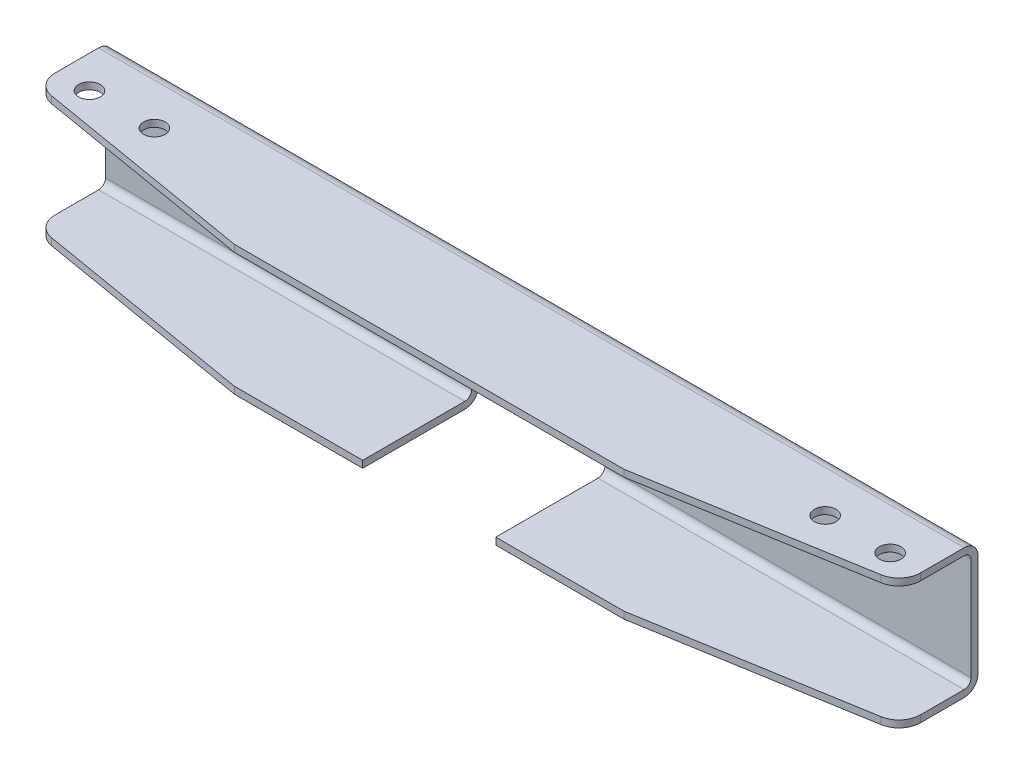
ISO-10303-21;
HEADER;
FILE_DESCRIPTION(('STEP AP214'),'2;1');
FILE_NAME('part.step','',(''),(''),'','','');
FILE_SCHEMA(('AUTOMOTIVE_DESIGN { 1 0 10303 214 1 1 1 1 }'));
ENDSEC;
DATA;
#1=APPLICATION_CONTEXT('core data for automotive mechanical design processes');
#2=APPLICATION_PROTOCOL_DEFINITION('international standard','automotive_design',2000,#1);
#3=PRODUCT_CONTEXT('',#1,'mechanical');
#4=PRODUCT('Part','Part','',(#3));
#5=PRODUCT_RELATED_PRODUCT_CATEGORY('part','',(#4));
#6=PRODUCT_DEFINITION_FORMATION('','',#4);
#7=PRODUCT_DEFINITION_CONTEXT('part definition',#1,'design');
#8=PRODUCT_DEFINITION('design','',#6,#7);
#9=PRODUCT_DEFINITION_SHAPE('','',#8);
#10=(LENGTH_UNIT() NAMED_UNIT(*) SI_UNIT(.MILLI.,.METRE.));
#11=(NAMED_UNIT(*) PLANE_ANGLE_UNIT() SI_UNIT($,.RADIAN.));
#12=(NAMED_UNIT(*) SI_UNIT($,.STERADIAN.) SOLID_ANGLE_UNIT());
#13=UNCERTAINTY_MEASURE_WITH_UNIT(LENGTH_MEASURE(1.E-05),#10,'distance_accuracy_value','');
#14=(GEOMETRIC_REPRESENTATION_CONTEXT(3) GLOBAL_UNCERTAINTY_ASSIGNED_CONTEXT((#13)) GLOBAL_UNIT_ASSIGNED_CONTEXT((#10,
#11,#12)) REPRESENTATION_CONTEXT('',''));
#15=CARTESIAN_POINT('',(0.,0.,0.));
#16=DIRECTION('',(0.,0.,1.));
#17=DIRECTION('',(1.,0.,0.));
#18=AXIS2_PLACEMENT_3D('',#15,#16,#17);
#19=CARTESIAN_POINT('',(400.,-30.,-23.6));
#20=DIRECTION('',(0.,1.,0.));
#21=DIRECTION('',(0.,0.,1.));
#22=AXIS2_PLACEMENT_3D('',#19,#20,#21);
#23=PLANE('',#22);
#24=DIRECTION('',(-0.986003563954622,0.,-0.166724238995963));
#25=VECTOR('',#24,1.);
#26=CARTESIAN_POINT('',(0.,-30.,5.));
#27=LINE('',#26,#25);
#28=CARTESIAN_POINT('',(110.,-30.,23.6));
#29=VERTEX_POINT('',#28);
#30=CARTESIAN_POINT('',(8.33275761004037,-30.,6.40899355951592));
#31=VERTEX_POINT('',#30);
#32=EDGE_CURVE('E552',#29,#31,#27,.T.);
#33=ORIENTED_EDGE('',*,*,#32,.T.);
#34=CARTESIAN_POINT('',(10.,-30.,-3.4510420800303));
#35=DIRECTION('',(0.,1.,0.));
#36=DIRECTION('',(0.,0.,1.));
#37=AXIS2_PLACEMENT_3D('',#34,#35,#36);
#38=CIRCLE('',#37,10.);
#39=CARTESIAN_POINT('',(0.,-30.,-3.45104208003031));
#40=VERTEX_POINT('',#39);
#41=EDGE_CURVE('E83',#31,#40,#38,.F.);
#42=ORIENTED_EDGE('',*,*,#41,.T.);
#43=DIRECTION('',(0.,0.,-1.));
#44=VECTOR('',#43,1.);
#45=CARTESIAN_POINT('',(0.,-30.,-23.6));
#46=LINE('',#45,#44);
#47=CARTESIAN_POINT('',(0.,-30.,-23.6));
#48=VERTEX_POINT('',#47);
#49=EDGE_CURVE('E419',#40,#48,#46,.T.);
#50=ORIENTED_EDGE('',*,*,#49,.T.);
#51=DIRECTION('',(-1.,0.,0.));
#52=VECTOR('',#51,1.);
#53=CARTESIAN_POINT('',(400.,-30.,-23.6));
#54=LINE('',#53,#52);
#55=CARTESIAN_POINT('',(169.25,-30.,-23.6));
#56=VERTEX_POINT('',#55);
#57=EDGE_CURVE('E445',#56,#48,#54,.T.);
#58=ORIENTED_EDGE('',*,*,#57,.F.);
#59=DIRECTION('',(0.,0.,-1.));
#60=VECTOR('',#59,1.);
#61=CARTESIAN_POINT('',(169.25,-30.,23.601));
#62=LINE('',#61,#60);
#63=CARTESIAN_POINT('',(169.25,-30.,23.6));
#64=VERTEX_POINT('',#63);
#65=EDGE_CURVE('E584',#64,#56,#62,.T.);
#66=ORIENTED_EDGE('',*,*,#65,.F.);
#67=DIRECTION('',(-1.,0.,0.));
#68=VECTOR('',#67,1.);
#69=CARTESIAN_POINT('',(400.,-30.,23.6));
#70=LINE('',#69,#68);
#71=EDGE_CURVE('E447',#64,#29,#70,.T.);
#72=ORIENTED_EDGE('',*,*,#71,.T.);
#73=EDGE_LOOP('',(#33,#42,#50,#58,#66,#72));
#74=FACE_BOUND('',#73,.T.);
#75=ADVANCED_FACE('F60',(#74),#23,.F.);
#76=CARTESIAN_POINT('',(400.,-26.8,-23.6));
#77=DIRECTION('',(0.,1.,0.));
#78=DIRECTION('',(0.,0.,1.));
#79=AXIS2_PLACEMENT_3D('',#76,#77,#78);
#80=PLANE('',#79);
#81=DIRECTION('',(0.,0.,-1.));
#82=VECTOR('',#81,1.);
#83=CARTESIAN_POINT('',(0.,-26.8,-23.6));
#84=LINE('',#83,#82);
#85=CARTESIAN_POINT('',(0.,-26.8,-3.45104208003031));
#86=VERTEX_POINT('',#85);
#87=CARTESIAN_POINT('',(0.,-26.8,-23.6));
#88=VERTEX_POINT('',#87);
#89=EDGE_CURVE('E337',#86,#88,#84,.T.);
#90=ORIENTED_EDGE('',*,*,#89,.F.);
#91=CARTESIAN_POINT('',(10.,-26.8,-3.4510420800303));
#92=DIRECTION('',(0.,1.,0.));
#93=DIRECTION('',(0.,0.,1.));
#94=AXIS2_PLACEMENT_3D('',#91,#92,#93);
#95=CIRCLE('',#94,10.);
#96=CARTESIAN_POINT('',(8.33275761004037,-26.8,6.40899355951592));
#97=VERTEX_POINT('',#96);
#98=EDGE_CURVE('E68',#86,#97,#95,.T.);
#99=ORIENTED_EDGE('',*,*,#98,.T.);
#100=DIRECTION('',(-0.986003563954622,0.,-0.166724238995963));
#101=VECTOR('',#100,1.);
#102=CARTESIAN_POINT('',(0.,-26.8,5.));
#103=LINE('',#102,#101);
#104=CARTESIAN_POINT('',(110.,-26.8,23.6));
#105=VERTEX_POINT('',#104);
#106=EDGE_CURVE('E335',#105,#97,#103,.T.);
#107=ORIENTED_EDGE('',*,*,#106,.F.);
#108=DIRECTION('',(-1.,0.,0.));
#109=VECTOR('',#108,1.);
#110=CARTESIAN_POINT('',(400.,-26.8,23.6));
#111=LINE('',#110,#109);
#112=CARTESIAN_POINT('',(169.25,-26.8,23.6));
#113=VERTEX_POINT('',#112);
#114=EDGE_CURVE('E404',#113,#105,#111,.T.);
#115=ORIENTED_EDGE('',*,*,#114,.F.);
#116=DIRECTION('',(0.,0.,1.));
#117=VECTOR('',#116,1.);
#118=CARTESIAN_POINT('',(169.25,-26.8,23.601));
#119=LINE('',#118,#117);
#120=CARTESIAN_POINT('',(169.25,-26.8,-23.6));
#121=VERTEX_POINT('',#120);
#122=EDGE_CURVE('E267',#121,#113,#119,.T.);
#123=ORIENTED_EDGE('',*,*,#122,.F.);
#124=DIRECTION('',(-1.,0.,0.));
#125=VECTOR('',#124,1.);
#126=CARTESIAN_POINT('',(400.,-26.8,-23.6));
#127=LINE('',#126,#125);
#128=EDGE_CURVE('E451',#121,#88,#127,.T.);
#129=ORIENTED_EDGE('',*,*,#128,.T.);
#130=EDGE_LOOP('',(#90,#99,#107,#115,#123,#129));
#131=FACE_BOUND('',#130,.T.);
#132=ADVANCED_FACE('F333',(#131),#80,.T.);
#133=CARTESIAN_POINT('',(0.,-30.,23.6));
#134=DIRECTION('',(0.,0.,1.));
#135=DIRECTION('',(1.,0.,0.));
#136=AXIS2_PLACEMENT_3D('',#133,#134,#135);
#137=PLANE('',#136);
#138=DIRECTION('',(0.,-1.,0.));
#139=VECTOR('',#138,1.);
#140=CARTESIAN_POINT('',(169.25,26.8,23.6));
#141=LINE('',#140,#139);
#142=EDGE_CURVE('E459',#113,#64,#141,.T.);
#143=ORIENTED_EDGE('',*,*,#142,.F.);
#144=ORIENTED_EDGE('',*,*,#114,.T.);
#145=DIRECTION('',(0.,-1.,0.));
#146=VECTOR('',#145,1.);
#147=CARTESIAN_POINT('',(110.,30.001,23.6));
#148=LINE('',#147,#146);
#149=EDGE_CURVE('E345',#105,#29,#148,.T.);
#150=ORIENTED_EDGE('',*,*,#149,.T.);
#151=ORIENTED_EDGE('',*,*,#71,.F.);
#152=EDGE_LOOP('',(#143,#144,#150,#151));
#153=FACE_BOUND('',#152,.T.);
#154=ADVANCED_FACE('F365',(#153),#137,.T.);
#155=CARTESIAN_POINT('',(400.,-23.6,-23.6));
#156=DIRECTION('',(-1.,0.,0.));
#157=DIRECTION('',(0.,0.,1.));
#158=AXIS2_PLACEMENT_3D('',#155,#156,#157);
#159=CYLINDRICAL_SURFACE('',#158,6.4);
#160=DIRECTION('',(-1.,0.,0.));
#161=VECTOR('',#160,1.);
#162=CARTESIAN_POINT('',(400.,-23.6,-30.));
#163=LINE('',#162,#161);
#164=CARTESIAN_POINT('',(169.25,-23.6,-30.));
#165=VERTEX_POINT('',#164);
#166=CARTESIAN_POINT('',(0.,-23.6,-30.));
#167=VERTEX_POINT('',#166);
#168=EDGE_CURVE('E441',#165,#167,#163,.T.);
#169=ORIENTED_EDGE('',*,*,#168,.F.);
#170=CARTESIAN_POINT('',(169.25,-23.6,-23.6));
#171=DIRECTION('',(-1.,0.,0.));
#172=DIRECTION('',(0.,0.,1.));
#173=AXIS2_PLACEMENT_3D('',#170,#171,#172);
#174=CIRCLE('',#173,6.4);
#175=EDGE_CURVE('E527',#56,#165,#174,.F.);
#176=ORIENTED_EDGE('',*,*,#175,.F.);
#177=ORIENTED_EDGE('',*,*,#57,.T.);
#178=CARTESIAN_POINT('',(0.,-23.6,-23.6));
#179=DIRECTION('',(1.,0.,0.));
#180=DIRECTION('',(0.,0.,-1.));
#181=AXIS2_PLACEMENT_3D('',#178,#179,#180);
#182=CIRCLE('',#181,6.4);
#183=EDGE_CURVE('E421',#48,#167,#182,.T.);
#184=ORIENTED_EDGE('',*,*,#183,.T.);
#185=EDGE_LOOP('',(#169,#176,#177,#184));
#186=FACE_BOUND('',#185,.T.);
#187=ADVANCED_FACE('F667',(#186),#159,.T.);
#188=CARTESIAN_POINT('',(400.,-23.6,-30.));
#189=DIRECTION('',(0.,0.,1.));
#190=DIRECTION('',(0.,-1.,0.));
#191=AXIS2_PLACEMENT_3D('',#188,#189,#190);
#192=PLANE('',#191);
#193=DIRECTION('',(-1.,0.,0.));
#194=VECTOR('',#193,1.);
#195=CARTESIAN_POINT('',(400.,23.6,-30.));
#196=LINE('',#195,#194);
#197=CARTESIAN_POINT('',(169.25,23.6,-30.));
#198=VERTEX_POINT('',#197);
#199=CARTESIAN_POINT('',(0.,23.6,-30.));
#200=VERTEX_POINT('',#199);
#201=EDGE_CURVE('E437',#198,#200,#196,.T.);
#202=ORIENTED_EDGE('',*,*,#201,.F.);
#203=DIRECTION('',(0.,1.,0.));
#204=VECTOR('',#203,1.);
#205=CARTESIAN_POINT('',(169.25,26.8,-30.));
#206=LINE('',#205,#204);
#207=EDGE_CURVE('E535',#165,#198,#206,.T.);
#208=ORIENTED_EDGE('',*,*,#207,.F.);
#209=ORIENTED_EDGE('',*,*,#168,.T.);
#210=DIRECTION('',(0.,1.,0.));
#211=VECTOR('',#210,1.);
#212=CARTESIAN_POINT('',(0.,-23.6,-30.));
#213=LINE('',#212,#211);
#214=EDGE_CURVE('E424',#167,#200,#213,.T.);
#215=ORIENTED_EDGE('',*,*,#214,.T.);
#216=EDGE_LOOP('',(#202,#208,#209,#215));
#217=FACE_BOUND('',#216,.T.);
#218=ADVANCED_FACE('F665',(#217),#192,.F.);
#219=CARTESIAN_POINT('',(400.,23.6,-23.6));
#220=DIRECTION('',(-1.,0.,0.));
#221=DIRECTION('',(0.,0.,1.));
#222=AXIS2_PLACEMENT_3D('',#219,#220,#221);
#223=CYLINDRICAL_SURFACE('',#222,3.20000000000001);
#224=CARTESIAN_POINT('',(169.25,23.6,-23.6));
#225=DIRECTION('',(1.,0.,0.));
#226=DIRECTION('',(0.,0.,-1.));
#227=AXIS2_PLACEMENT_3D('',#224,#225,#226);
#228=CIRCLE('',#227,3.20000000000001);
#229=CARTESIAN_POINT('',(169.25,26.8,-23.6));
#230=VERTEX_POINT('',#229);
#231=CARTESIAN_POINT('',(169.25,23.6,-26.8));
#232=VERTEX_POINT('',#231);
#233=EDGE_CURVE('E478',#230,#232,#228,.F.);
#234=ORIENTED_EDGE('',*,*,#233,.F.);
#235=DIRECTION('',(-1.,0.,0.));
#236=VECTOR('',#235,1.);
#237=CARTESIAN_POINT('',(400.,26.8,-23.6));
#238=LINE('',#237,#236);
#239=CARTESIAN_POINT('',(0.,26.8,-23.6));
#240=VERTEX_POINT('',#239);
#241=EDGE_CURVE('E292',#230,#240,#238,.T.);
#242=ORIENTED_EDGE('',*,*,#241,.T.);
#243=CARTESIAN_POINT('',(0.,23.6,-23.6));
#244=DIRECTION('',(1.,0.,0.));
#245=DIRECTION('',(0.,0.,-1.));
#246=AXIS2_PLACEMENT_3D('',#243,#244,#245);
#247=CIRCLE('',#246,3.20000000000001);
#248=CARTESIAN_POINT('',(0.,23.6,-26.8));
#249=VERTEX_POINT('',#248);
#250=EDGE_CURVE('E408',#249,#240,#247,.T.);
#251=ORIENTED_EDGE('',*,*,#250,.F.);
#252=DIRECTION('',(-1.,0.,0.));
#253=VECTOR('',#252,1.);
#254=CARTESIAN_POINT('',(400.,23.6,-26.8));
#255=LINE('',#254,#253);
#256=EDGE_CURVE('E284',#232,#249,#255,.T.);
#257=ORIENTED_EDGE('',*,*,#256,.F.);
#258=EDGE_LOOP('',(#234,#242,#251,#257));
#259=FACE_BOUND('',#258,.T.);
#260=ADVANCED_FACE('F475',(#259),#223,.F.);
#261=CARTESIAN_POINT('',(400.,-23.6,-26.8));
#262=DIRECTION('',(0.,0.,1.));
#263=DIRECTION('',(0.,-1.,0.));
#264=AXIS2_PLACEMENT_3D('',#261,#262,#263);
#265=PLANE('',#264);
#266=DIRECTION('',(0.,-1.,0.));
#267=VECTOR('',#266,1.);
#268=CARTESIAN_POINT('',(169.25,26.8,-26.8));
#269=LINE('',#268,#267);
#270=CARTESIAN_POINT('',(169.25,-23.6,-26.8));
#271=VERTEX_POINT('',#270);
#272=EDGE_CURVE('E278',#232,#271,#269,.T.);
#273=ORIENTED_EDGE('',*,*,#272,.F.);
#274=ORIENTED_EDGE('',*,*,#256,.T.);
#275=DIRECTION('',(0.,1.,0.));
#276=VECTOR('',#275,1.);
#277=CARTESIAN_POINT('',(0.,-23.6,-26.8));
#278=LINE('',#277,#276);
#279=CARTESIAN_POINT('',(0.,-23.6,-26.8));
#280=VERTEX_POINT('',#279);
#281=EDGE_CURVE('E412',#280,#249,#278,.T.);
#282=ORIENTED_EDGE('',*,*,#281,.F.);
#283=DIRECTION('',(-1.,0.,0.));
#284=VECTOR('',#283,1.);
#285=CARTESIAN_POINT('',(400.,-23.6,-26.8));
#286=LINE('',#285,#284);
#287=EDGE_CURVE('E285',#271,#280,#286,.T.);
#288=ORIENTED_EDGE('',*,*,#287,.F.);
#289=EDGE_LOOP('',(#273,#274,#282,#288));
#290=FACE_BOUND('',#289,.T.);
#291=ADVANCED_FACE('F378',(#290),#265,.T.);
#292=CARTESIAN_POINT('',(400.,-23.6,-23.6));
#293=DIRECTION('',(-1.,0.,0.));
#294=DIRECTION('',(0.,0.,1.));
#295=AXIS2_PLACEMENT_3D('',#292,#293,#294);
#296=CYLINDRICAL_SURFACE('',#295,3.2);
#297=CARTESIAN_POINT('',(169.25,-23.6,-23.6));
#298=DIRECTION('',(1.,0.,0.));
#299=DIRECTION('',(0.,0.,-1.));
#300=AXIS2_PLACEMENT_3D('',#297,#298,#299);
#301=CIRCLE('',#300,3.2);
#302=EDGE_CURVE('E268',#271,#121,#301,.F.);
#303=ORIENTED_EDGE('',*,*,#302,.F.);
#304=ORIENTED_EDGE('',*,*,#287,.T.);
#305=CARTESIAN_POINT('',(0.,-23.6,-23.6));
#306=DIRECTION('',(1.,0.,0.));
#307=DIRECTION('',(0.,0.,-1.));
#308=AXIS2_PLACEMENT_3D('',#305,#306,#307);
#309=CIRCLE('',#308,3.2);
#310=EDGE_CURVE('E415',#88,#280,#309,.T.);
#311=ORIENTED_EDGE('',*,*,#310,.F.);
#312=ORIENTED_EDGE('',*,*,#128,.F.);
#313=EDGE_LOOP('',(#303,#304,#311,#312));
#314=FACE_BOUND('',#313,.T.);
#315=ADVANCED_FACE('F370',(#314),#296,.F.);
#316=DIRECTION('',(0.,0.,-1.));
#317=VECTOR('',#316,1.);
#318=CARTESIAN_POINT('',(400.,-30.,-23.6));
#319=LINE('',#318,#317);
#320=CARTESIAN_POINT('',(400.,-30.,-3.45104208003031));
#321=VERTEX_POINT('',#320);
#322=CARTESIAN_POINT('',(400.,-30.,-23.6));
#323=VERTEX_POINT('',#322);
#324=EDGE_CURVE('E383',#321,#323,#319,.T.);
#325=ORIENTED_EDGE('',*,*,#324,.F.);
#326=CARTESIAN_POINT('',(390.,-30.,-3.4510420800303));
#327=DIRECTION('',(0.,1.,0.));
#328=DIRECTION('',(0.,0.,1.));
#329=AXIS2_PLACEMENT_3D('',#326,#327,#328);
#330=CIRCLE('',#329,10.);
#331=CARTESIAN_POINT('',(391.66724238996,-30.,6.40899355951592));
#332=VERTEX_POINT('',#331);
#333=EDGE_CURVE('E305',#321,#332,#330,.F.);
#334=ORIENTED_EDGE('',*,*,#333,.T.);
#335=DIRECTION('',(-0.986003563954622,0.,0.166724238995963));
#336=VECTOR('',#335,1.);
#337=CARTESIAN_POINT('',(290.,-30.,23.6));
#338=LINE('',#337,#336);
#339=CARTESIAN_POINT('',(290.,-30.,23.6));
#340=VERTEX_POINT('',#339);
#341=EDGE_CURVE('E545',#332,#340,#338,.T.);
#342=ORIENTED_EDGE('',*,*,#341,.T.);
#343=CARTESIAN_POINT('',(230.75,-30.,23.6));
#344=VERTEX_POINT('',#343);
#345=EDGE_CURVE('E302',#340,#344,#70,.T.);
#346=ORIENTED_EDGE('',*,*,#345,.T.);
#347=DIRECTION('',(0.,0.,-1.));
#348=VECTOR('',#347,1.);
#349=CARTESIAN_POINT('',(230.75,-30.,23.601));
#350=LINE('',#349,#348);
#351=CARTESIAN_POINT('',(230.75,-30.,-23.6));
#352=VERTEX_POINT('',#351);
#353=EDGE_CURVE('E582',#344,#352,#350,.T.);
#354=ORIENTED_EDGE('',*,*,#353,.T.);
#355=EDGE_CURVE('E387',#323,#352,#54,.T.);
#356=ORIENTED_EDGE('',*,*,#355,.F.);
#357=EDGE_LOOP('',(#325,#334,#342,#346,#354,#356));
#358=FACE_BOUND('',#357,.T.);
#359=ADVANCED_FACE('F361',(#358),#23,.F.);
#360=DIRECTION('',(-0.986003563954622,0.,0.166724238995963));
#361=VECTOR('',#360,1.);
#362=CARTESIAN_POINT('',(290.,-26.8,23.6));
#363=LINE('',#362,#361);
#364=CARTESIAN_POINT('',(391.66724238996,-26.8,6.40899355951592));
#365=VERTEX_POINT('',#364);
#366=CARTESIAN_POINT('',(290.,-26.8,23.6));
#367=VERTEX_POINT('',#366);
#368=EDGE_CURVE('E550',#365,#367,#363,.T.);
#369=ORIENTED_EDGE('',*,*,#368,.F.);
#370=CARTESIAN_POINT('',(390.,-26.8,-3.4510420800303));
#371=DIRECTION('',(0.,1.,0.));
#372=DIRECTION('',(0.,0.,1.));
#373=AXIS2_PLACEMENT_3D('',#370,#371,#372);
#374=CIRCLE('',#373,10.);
#375=CARTESIAN_POINT('',(400.,-26.8,-3.45104208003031));
#376=VERTEX_POINT('',#375);
#377=EDGE_CURVE('E309',#365,#376,#374,.T.);
#378=ORIENTED_EDGE('',*,*,#377,.T.);
#379=DIRECTION('',(0.,0.,-1.));
#380=VECTOR('',#379,1.);
#381=CARTESIAN_POINT('',(400.,-26.8,-23.6));
#382=LINE('',#381,#380);
#383=CARTESIAN_POINT('',(400.,-26.8,-23.6));
#384=VERTEX_POINT('',#383);
#385=EDGE_CURVE('E391',#376,#384,#382,.T.);
#386=ORIENTED_EDGE('',*,*,#385,.T.);
#387=CARTESIAN_POINT('',(230.75,-26.8,-23.6));
#388=VERTEX_POINT('',#387);
#389=EDGE_CURVE('E288',#384,#388,#127,.T.);
#390=ORIENTED_EDGE('',*,*,#389,.T.);
#391=DIRECTION('',(0.,0.,-1.));
#392=VECTOR('',#391,1.);
#393=CARTESIAN_POINT('',(230.75,-26.8,23.601));
#394=LINE('',#393,#392);
#395=CARTESIAN_POINT('',(230.75,-26.8,23.6));
#396=VERTEX_POINT('',#395);
#397=EDGE_CURVE('E262',#396,#388,#394,.T.);
#398=ORIENTED_EDGE('',*,*,#397,.F.);
#399=EDGE_CURVE('E449',#367,#396,#111,.T.);
#400=ORIENTED_EDGE('',*,*,#399,.F.);
#401=EDGE_LOOP('',(#369,#378,#386,#390,#398,#400));
#402=FACE_BOUND('',#401,.T.);
#403=ADVANCED_FACE('F367',(#402),#80,.T.);
#404=DIRECTION('',(0.,1.,0.));
#405=VECTOR('',#404,1.);
#406=CARTESIAN_POINT('',(230.75,26.8,23.6));
#407=LINE('',#406,#405);
#408=EDGE_CURVE('E592',#344,#396,#407,.T.);
#409=ORIENTED_EDGE('',*,*,#408,.F.);
#410=ORIENTED_EDGE('',*,*,#345,.F.);
#411=DIRECTION('',(0.,-1.,0.));
#412=VECTOR('',#411,1.);
#413=CARTESIAN_POINT('',(290.,30.001,23.6));
#414=LINE('',#413,#412);
#415=EDGE_CURVE('E547',#367,#340,#414,.T.);
#416=ORIENTED_EDGE('',*,*,#415,.F.);
#417=ORIENTED_EDGE('',*,*,#399,.T.);
#418=EDGE_LOOP('',(#409,#410,#416,#417));
#419=FACE_BOUND('',#418,.T.);
#420=ADVANCED_FACE('F376',(#419),#137,.T.);
#421=CARTESIAN_POINT('',(400.,23.6,23.6));
#422=DIRECTION('',(1.,0.,0.));
#423=DIRECTION('',(0.,0.,-1.));
#424=AXIS2_PLACEMENT_3D('',#421,#422,#423);
#425=PLANE('',#424);
#426=ORIENTED_EDGE('',*,*,#385,.F.);
#427=DIRECTION('',(0.,-1.,0.));
#428=VECTOR('',#427,1.);
#429=CARTESIAN_POINT('',(400.,23.6,-3.4510420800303));
#430=LINE('',#429,#428);
#431=EDGE_CURVE('E301',#376,#321,#430,.T.);
#432=ORIENTED_EDGE('',*,*,#431,.T.);
#433=ORIENTED_EDGE('',*,*,#324,.T.);
#434=CARTESIAN_POINT('',(400.,-23.6,-23.6));
#435=DIRECTION('',(1.,0.,0.));
#436=DIRECTION('',(0.,0.,-1.));
#437=AXIS2_PLACEMENT_3D('',#434,#435,#436);
#438=CIRCLE('',#437,6.4);
#439=CARTESIAN_POINT('',(400.,-23.6,-30.));
#440=VERTEX_POINT('',#439);
#441=EDGE_CURVE('E390',#323,#440,#438,.T.);
#442=ORIENTED_EDGE('',*,*,#441,.T.);
#443=DIRECTION('',(0.,1.,0.));
#444=VECTOR('',#443,1.);
#445=CARTESIAN_POINT('',(400.,-23.6,-30.));
#446=LINE('',#445,#444);
#447=CARTESIAN_POINT('',(400.,23.6,-30.));
#448=VERTEX_POINT('',#447);
#449=EDGE_CURVE('E393',#440,#448,#446,.T.);
#450=ORIENTED_EDGE('',*,*,#449,.T.);
#451=CARTESIAN_POINT('',(400.,23.6,-23.6));
#452=DIRECTION('',(1.,0.,0.));
#453=DIRECTION('',(0.,0.,-1.));
#454=AXIS2_PLACEMENT_3D('',#451,#452,#453);
#455=CIRCLE('',#454,6.4);
#456=CARTESIAN_POINT('',(400.,30.,-23.6));
#457=VERTEX_POINT('',#456);
#458=EDGE_CURVE('E399',#448,#457,#455,.T.);
#459=ORIENTED_EDGE('',*,*,#458,.T.);
#460=DIRECTION('',(0.,0.,1.));
#461=VECTOR('',#460,1.);
#462=CARTESIAN_POINT('',(400.,30.,23.6));
#463=LINE('',#462,#461);
#464=CARTESIAN_POINT('',(400.,30.,-3.4510420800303));
#465=VERTEX_POINT('',#464);
#466=EDGE_CURVE('E401',#457,#465,#463,.T.);
#467=ORIENTED_EDGE('',*,*,#466,.T.);
#468=DIRECTION('',(0.,1.,0.));
#469=VECTOR('',#468,1.);
#470=CARTESIAN_POINT('',(400.,26.8,-3.4510420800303));
#471=LINE('',#470,#469);
#472=CARTESIAN_POINT('',(400.,26.8,-3.4510420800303));
#473=VERTEX_POINT('',#472);
#474=EDGE_CURVE('E299',#465,#473,#471,.F.);
#475=ORIENTED_EDGE('',*,*,#474,.T.);
#476=DIRECTION('',(0.,0.,1.));
#477=VECTOR('',#476,1.);
#478=CARTESIAN_POINT('',(400.,26.8,23.6));
#479=LINE('',#478,#477);
#480=CARTESIAN_POINT('',(400.,26.8,-23.6));
#481=VERTEX_POINT('',#480);
#482=EDGE_CURVE('E432',#481,#473,#479,.T.);
#483=ORIENTED_EDGE('',*,*,#482,.F.);
#484=CARTESIAN_POINT('',(400.,23.6,-23.6));
#485=DIRECTION('',(1.,0.,0.));
#486=DIRECTION('',(0.,0.,-1.));
#487=AXIS2_PLACEMENT_3D('',#484,#485,#486);
#488=CIRCLE('',#487,3.20000000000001);
#489=CARTESIAN_POINT('',(400.,23.6,-26.8));
#490=VERTEX_POINT('',#489);
#491=EDGE_CURVE('E509',#490,#481,#488,.T.);
#492=ORIENTED_EDGE('',*,*,#491,.F.);
#493=DIRECTION('',(0.,1.,0.));
#494=VECTOR('',#493,1.);
#495=CARTESIAN_POINT('',(400.,-23.6,-26.8));
#496=LINE('',#495,#494);
#497=CARTESIAN_POINT('',(400.,-23.6,-26.8));
#498=VERTEX_POINT('',#497);
#499=EDGE_CURVE('E512',#498,#490,#496,.T.);
#500=ORIENTED_EDGE('',*,*,#499,.F.);
#501=CARTESIAN_POINT('',(400.,-23.6,-23.6));
#502=DIRECTION('',(1.,0.,0.));
#503=DIRECTION('',(0.,0.,-1.));
#504=AXIS2_PLACEMENT_3D('',#501,#502,#503);
#505=CIRCLE('',#504,3.2);
#506=EDGE_CURVE('E283',#384,#498,#505,.T.);
#507=ORIENTED_EDGE('',*,*,#506,.F.);
#508=EDGE_LOOP('',(#426,#432,#433,#442,#450,#459,#467,#475,#483,#492,#500,#507));
#509=FACE_BOUND('',#508,.T.);
#510=ADVANCED_FACE('F515',(#509),#425,.T.);
#511=CARTESIAN_POINT('',(0.,23.6,23.6));
#512=DIRECTION('',(1.,0.,0.));
#513=DIRECTION('',(0.,0.,-1.));
#514=AXIS2_PLACEMENT_3D('',#511,#512,#513);
#515=PLANE('',#514);
#516=ORIENTED_EDGE('',*,*,#49,.F.);
#517=DIRECTION('',(0.,-1.,0.));
#518=VECTOR('',#517,1.);
#519=CARTESIAN_POINT('',(0.,-26.8,-3.4510420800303));
#520=LINE('',#519,#518);
#521=EDGE_CURVE('E75',#40,#86,#520,.F.);
#522=ORIENTED_EDGE('',*,*,#521,.T.);
#523=ORIENTED_EDGE('',*,*,#89,.T.);
#524=ORIENTED_EDGE('',*,*,#310,.T.);
#525=ORIENTED_EDGE('',*,*,#281,.T.);
#526=ORIENTED_EDGE('',*,*,#250,.T.);
#527=DIRECTION('',(0.,0.,1.));
#528=VECTOR('',#527,1.);
#529=CARTESIAN_POINT('',(0.,26.8,23.6));
#530=LINE('',#529,#528);
#531=CARTESIAN_POINT('',(0.,26.8,-3.4510420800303));
#532=VERTEX_POINT('',#531);
#533=EDGE_CURVE('E405',#240,#532,#530,.T.);
#534=ORIENTED_EDGE('',*,*,#533,.T.);
#535=DIRECTION('',(0.,1.,0.));
#536=VECTOR('',#535,1.);
#537=CARTESIAN_POINT('',(0.,23.6,-3.4510420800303));
#538=LINE('',#537,#536);
#539=CARTESIAN_POINT('',(0.,30.,-3.4510420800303));
#540=VERTEX_POINT('',#539);
#541=EDGE_CURVE('E326',#532,#540,#538,.T.);
#542=ORIENTED_EDGE('',*,*,#541,.T.);
#543=DIRECTION('',(0.,0.,1.));
#544=VECTOR('',#543,1.);
#545=CARTESIAN_POINT('',(0.,30.,23.6));
#546=LINE('',#545,#544);
#547=CARTESIAN_POINT('',(0.,30.,-23.6));
#548=VERTEX_POINT('',#547);
#549=EDGE_CURVE('E429',#548,#540,#546,.T.);
#550=ORIENTED_EDGE('',*,*,#549,.F.);
#551=CARTESIAN_POINT('',(0.,23.6,-23.6));
#552=DIRECTION('',(1.,0.,0.));
#553=DIRECTION('',(0.,0.,-1.));
#554=AXIS2_PLACEMENT_3D('',#551,#552,#553);
#555=CIRCLE('',#554,6.4);
#556=EDGE_CURVE('E427',#200,#548,#555,.T.);
#557=ORIENTED_EDGE('',*,*,#556,.F.);
#558=ORIENTED_EDGE('',*,*,#214,.F.);
#559=ORIENTED_EDGE('',*,*,#183,.F.);
#560=EDGE_LOOP('',(#516,#522,#523,#524,#525,#526,#534,#542,#550,#557,#558,#559));
#561=FACE_BOUND('',#560,.T.);
#562=ADVANCED_FACE('F468',(#561),#515,.F.);
#563=ORIENTED_EDGE('',*,*,#355,.T.);
#564=CARTESIAN_POINT('',(230.75,-23.6,-23.6));
#565=DIRECTION('',(1.,0.,0.));
#566=DIRECTION('',(0.,0.,-1.));
#567=AXIS2_PLACEMENT_3D('',#564,#565,#566);
#568=CIRCLE('',#567,6.4);
#569=CARTESIAN_POINT('',(230.75,-23.6,-30.));
#570=VERTEX_POINT('',#569);
#571=EDGE_CURVE('E521',#570,#352,#568,.F.);
#572=ORIENTED_EDGE('',*,*,#571,.F.);
#573=EDGE_CURVE('E442',#440,#570,#163,.T.);
#574=ORIENTED_EDGE('',*,*,#573,.F.);
#575=ORIENTED_EDGE('',*,*,#441,.F.);
#576=EDGE_LOOP('',(#563,#572,#574,#575));
#577=FACE_BOUND('',#576,.T.);
#578=ADVANCED_FACE('F581',(#577),#159,.T.);
#579=ORIENTED_EDGE('',*,*,#573,.T.);
#580=DIRECTION('',(0.,-1.,0.));
#581=VECTOR('',#580,1.);
#582=CARTESIAN_POINT('',(230.75,26.8,-30.));
#583=LINE('',#582,#581);
#584=CARTESIAN_POINT('',(230.75,23.6,-30.));
#585=VERTEX_POINT('',#584);
#586=EDGE_CURVE('E543',#585,#570,#583,.T.);
#587=ORIENTED_EDGE('',*,*,#586,.F.);
#588=EDGE_CURVE('E438',#448,#585,#196,.T.);
#589=ORIENTED_EDGE('',*,*,#588,.F.);
#590=ORIENTED_EDGE('',*,*,#449,.F.);
#591=EDGE_LOOP('',(#579,#587,#589,#590));
#592=FACE_BOUND('',#591,.T.);
#593=ADVANCED_FACE('F574',(#592),#192,.F.);
#594=CARTESIAN_POINT('',(400.,23.6,-23.6));
#595=DIRECTION('',(-1.,0.,0.));
#596=DIRECTION('',(0.,0.,1.));
#597=AXIS2_PLACEMENT_3D('',#594,#595,#596);
#598=CYLINDRICAL_SURFACE('',#597,6.4);
#599=DIRECTION('',(-1.,0.,0.));
#600=VECTOR('',#599,1.);
#601=CARTESIAN_POINT('',(400.,26.8,-29.1425625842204));
#602=LINE('',#601,#600);
#603=CARTESIAN_POINT('',(169.25,26.8,-29.1425625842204));
#604=VERTEX_POINT('',#603);
#605=CARTESIAN_POINT('',(230.75,26.8,-29.1425625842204));
#606=VERTEX_POINT('',#605);
#607=EDGE_CURVE('E529',#604,#606,#602,.F.);
#608=ORIENTED_EDGE('',*,*,#607,.F.);
#609=CARTESIAN_POINT('',(169.25,23.6,-23.6));
#610=DIRECTION('',(-1.,0.,0.));
#611=DIRECTION('',(0.,0.,1.));
#612=AXIS2_PLACEMENT_3D('',#609,#610,#611);
#613=CIRCLE('',#612,6.4);
#614=EDGE_CURVE('E532',#198,#604,#613,.F.);
#615=ORIENTED_EDGE('',*,*,#614,.F.);
#616=ORIENTED_EDGE('',*,*,#201,.T.);
#617=ORIENTED_EDGE('',*,*,#556,.T.);
#618=DIRECTION('',(-1.,0.,0.));
#619=VECTOR('',#618,1.);
#620=CARTESIAN_POINT('',(400.,30.,-23.6));
#621=LINE('',#620,#619);
#622=EDGE_CURVE('E434',#457,#548,#621,.T.);
#623=ORIENTED_EDGE('',*,*,#622,.F.);
#624=ORIENTED_EDGE('',*,*,#458,.F.);
#625=ORIENTED_EDGE('',*,*,#588,.T.);
#626=CARTESIAN_POINT('',(230.75,23.6,-23.6));
#627=DIRECTION('',(1.,0.,0.));
#628=DIRECTION('',(0.,0.,-1.));
#629=AXIS2_PLACEMENT_3D('',#626,#627,#628);
#630=CIRCLE('',#629,6.4);
#631=EDGE_CURVE('E540',#606,#585,#630,.F.);
#632=ORIENTED_EDGE('',*,*,#631,.F.);
#633=EDGE_LOOP('',(#608,#615,#616,#617,#623,#624,#625,#632));
#634=FACE_BOUND('',#633,.T.);
#635=ADVANCED_FACE('F578',(#634),#598,.T.);
#636=CARTESIAN_POINT('',(400.,26.8,23.6));
#637=DIRECTION('',(0.,-1.,0.));
#638=DIRECTION('',(0.,0.,-1.));
#639=AXIS2_PLACEMENT_3D('',#636,#637,#638);
#640=PLANE('',#639);
#641=CARTESIAN_POINT('',(385.,26.8,-4.40000000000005));
#642=DIRECTION('',(0.,-1.,0.));
#643=DIRECTION('',(0.,0.,-1.));
#644=AXIS2_PLACEMENT_3D('',#641,#642,#643);
#645=CIRCLE('',#644,4.99999999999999);
#646=CARTESIAN_POINT('',(385.,26.8,-9.40000000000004));
#647=VERTEX_POINT('',#646);
#648=EDGE_CURVE('E610',#647,#647,#645,.F.);
#649=ORIENTED_EDGE('',*,*,#648,.T.);
#650=EDGE_LOOP('',(#649));
#651=FACE_BOUND('',#650,.T.);
#652=CARTESIAN_POINT('',(355.,26.8,-4.40000000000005));
#653=DIRECTION('',(0.,-1.,0.));
#654=DIRECTION('',(0.,0.,-1.));
#655=AXIS2_PLACEMENT_3D('',#652,#653,#654);
#656=CIRCLE('',#655,4.99999999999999);
#657=CARTESIAN_POINT('',(355.,26.8,-9.40000000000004));
#658=VERTEX_POINT('',#657);
#659=EDGE_CURVE('E604',#658,#658,#656,.F.);
#660=ORIENTED_EDGE('',*,*,#659,.T.);
#661=EDGE_LOOP('',(#660));
#662=FACE_BOUND('',#661,.T.);
#663=CARTESIAN_POINT('',(45.,26.8,-4.40000000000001));
#664=DIRECTION('',(0.,-1.,0.));
#665=DIRECTION('',(0.,0.,-1.));
#666=AXIS2_PLACEMENT_3D('',#663,#664,#665);
#667=CIRCLE('',#666,5.);
#668=CARTESIAN_POINT('',(45.,26.8,-9.40000000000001));
#669=VERTEX_POINT('',#668);
#670=EDGE_CURVE('E598',#669,#669,#667,.F.);
#671=ORIENTED_EDGE('',*,*,#670,.T.);
#672=EDGE_LOOP('',(#671));
#673=FACE_BOUND('',#672,.T.);
#674=CARTESIAN_POINT('',(15.,26.8,-4.40000000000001));
#675=DIRECTION('',(0.,-1.,0.));
#676=DIRECTION('',(0.,0.,-1.));
#677=AXIS2_PLACEMENT_3D('',#674,#675,#676);
#678=CIRCLE('',#677,5.);
#679=CARTESIAN_POINT('',(15.,26.8,-9.40000000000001));
#680=VERTEX_POINT('',#679);
#681=EDGE_CURVE('E589',#680,#680,#678,.F.);
#682=ORIENTED_EDGE('',*,*,#681,.T.);
#683=EDGE_LOOP('',(#682));
#684=FACE_BOUND('',#683,.T.);
#685=ORIENTED_EDGE('',*,*,#482,.T.);
#686=CARTESIAN_POINT('',(390.,26.8,-3.4510420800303));
#687=DIRECTION('',(0.,-1.,0.));
#688=DIRECTION('',(0.,0.,-1.));
#689=AXIS2_PLACEMENT_3D('',#686,#687,#688);
#690=CIRCLE('',#689,10.);
#691=CARTESIAN_POINT('',(391.66724238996,26.8,6.40899355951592));
#692=VERTEX_POINT('',#691);
#693=EDGE_CURVE('E320',#473,#692,#690,.T.);
#694=ORIENTED_EDGE('',*,*,#693,.T.);
#695=DIRECTION('',(-0.986003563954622,0.,0.166724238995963));
#696=VECTOR('',#695,1.);
#697=CARTESIAN_POINT('',(290.,26.8,23.6));
#698=LINE('',#697,#696);
#699=CARTESIAN_POINT('',(290.,26.8,23.6));
#700=VERTEX_POINT('',#699);
#701=EDGE_CURVE('E346',#692,#700,#698,.T.);
#702=ORIENTED_EDGE('',*,*,#701,.T.);
#703=DIRECTION('',(-1.,0.,0.));
#704=VECTOR('',#703,1.);
#705=CARTESIAN_POINT('',(400.,26.8,23.6));
#706=LINE('',#705,#704);
#707=CARTESIAN_POINT('',(110.,26.8,23.6));
#708=VERTEX_POINT('',#707);
#709=EDGE_CURVE('E296',#700,#708,#706,.T.);
#710=ORIENTED_EDGE('',*,*,#709,.T.);
#711=DIRECTION('',(-0.986003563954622,0.,-0.166724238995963));
#712=VECTOR('',#711,1.);
#713=CARTESIAN_POINT('',(0.,26.8,5.));
#714=LINE('',#713,#712);
#715=CARTESIAN_POINT('',(8.33275761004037,26.8,6.40899355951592));
#716=VERTEX_POINT('',#715);
#717=EDGE_CURVE('E500',#708,#716,#714,.T.);
#718=ORIENTED_EDGE('',*,*,#717,.T.);
#719=CARTESIAN_POINT('',(10.,26.8,-3.4510420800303));
#720=DIRECTION('',(0.,-1.,0.));
#721=DIRECTION('',(0.,0.,-1.));
#722=AXIS2_PLACEMENT_3D('',#719,#720,#721);
#723=CIRCLE('',#722,10.);
#724=EDGE_CURVE('E318',#716,#532,#723,.T.);
#725=ORIENTED_EDGE('',*,*,#724,.T.);
#726=ORIENTED_EDGE('',*,*,#533,.F.);
#727=ORIENTED_EDGE('',*,*,#241,.F.);
#728=DIRECTION('',(0.,0.,1.));
#729=VECTOR('',#728,1.);
#730=CARTESIAN_POINT('',(169.25,26.8,-30.001));
#731=LINE('',#730,#729);
#732=EDGE_CURVE('E538',#604,#230,#731,.T.);
#733=ORIENTED_EDGE('',*,*,#732,.F.);
#734=ORIENTED_EDGE('',*,*,#607,.T.);
#735=DIRECTION('',(0.,0.,1.));
#736=VECTOR('',#735,1.);
#737=CARTESIAN_POINT('',(230.75,26.8,-30.001));
#738=LINE('',#737,#736);
#739=CARTESIAN_POINT('',(230.75,26.8,-23.6));
#740=VERTEX_POINT('',#739);
#741=EDGE_CURVE('E277',#606,#740,#738,.T.);
#742=ORIENTED_EDGE('',*,*,#741,.T.);
#743=EDGE_CURVE('E293',#481,#740,#238,.T.);
#744=ORIENTED_EDGE('',*,*,#743,.F.);
#745=EDGE_LOOP('',(#685,#694,#702,#710,#718,#725,#726,#727,#733,#734,#742,#744));
#746=FACE_BOUND('',#745,.T.);
#747=ADVANCED_FACE('F481',(#651,#662,#673,#684,#746),#640,.T.);
#748=CARTESIAN_POINT('',(230.75,23.6,-23.6));
#749=DIRECTION('',(-1.,0.,0.));
#750=DIRECTION('',(0.,0.,1.));
#751=AXIS2_PLACEMENT_3D('',#748,#749,#750);
#752=CIRCLE('',#751,3.20000000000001);
#753=CARTESIAN_POINT('',(230.75,23.6,-26.8));
#754=VERTEX_POINT('',#753);
#755=EDGE_CURVE('E519',#754,#740,#752,.F.);
#756=ORIENTED_EDGE('',*,*,#755,.F.);
#757=EDGE_CURVE('E276',#490,#754,#255,.T.);
#758=ORIENTED_EDGE('',*,*,#757,.F.);
#759=ORIENTED_EDGE('',*,*,#491,.T.);
#760=ORIENTED_EDGE('',*,*,#743,.T.);
#761=EDGE_LOOP('',(#756,#758,#759,#760));
#762=FACE_BOUND('',#761,.T.);
#763=ADVANCED_FACE('F518',(#762),#223,.F.);
#764=DIRECTION('',(0.,1.,0.));
#765=VECTOR('',#764,1.);
#766=CARTESIAN_POINT('',(230.75,26.8,-26.8));
#767=LINE('',#766,#765);
#768=CARTESIAN_POINT('',(230.75,-23.6,-26.8));
#769=VERTEX_POINT('',#768);
#770=EDGE_CURVE('E259',#769,#754,#767,.T.);
#771=ORIENTED_EDGE('',*,*,#770,.F.);
#772=EDGE_CURVE('E274',#498,#769,#286,.T.);
#773=ORIENTED_EDGE('',*,*,#772,.F.);
#774=ORIENTED_EDGE('',*,*,#499,.T.);
#775=ORIENTED_EDGE('',*,*,#757,.T.);
#776=EDGE_LOOP('',(#771,#773,#774,#775));
#777=FACE_BOUND('',#776,.T.);
#778=ADVANCED_FACE('F272',(#777),#265,.T.);
#779=CARTESIAN_POINT('',(230.75,-23.6,-23.6));
#780=DIRECTION('',(-1.,0.,0.));
#781=DIRECTION('',(0.,0.,1.));
#782=AXIS2_PLACEMENT_3D('',#779,#780,#781);
#783=CIRCLE('',#782,3.2);
#784=EDGE_CURVE('E255',#388,#769,#783,.F.);
#785=ORIENTED_EDGE('',*,*,#784,.F.);
#786=ORIENTED_EDGE('',*,*,#389,.F.);
#787=ORIENTED_EDGE('',*,*,#506,.T.);
#788=ORIENTED_EDGE('',*,*,#772,.T.);
#789=EDGE_LOOP('',(#785,#786,#787,#788));
#790=FACE_BOUND('',#789,.T.);
#791=ADVANCED_FACE('F281',(#790),#296,.F.);
#792=CARTESIAN_POINT('',(400.,30.,23.6));
#793=DIRECTION('',(0.,-1.,0.));
#794=DIRECTION('',(0.,0.,-1.));
#795=AXIS2_PLACEMENT_3D('',#792,#793,#794);
#796=PLANE('',#795);
#797=CARTESIAN_POINT('',(385.,30.,-4.40000000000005));
#798=DIRECTION('',(0.,1.,0.));
#799=DIRECTION('',(0.,0.,1.));
#800=AXIS2_PLACEMENT_3D('',#797,#798,#799);
#801=CIRCLE('',#800,4.99999999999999);
#802=CARTESIAN_POINT('',(385.,30.,0.599999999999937));
#803=VERTEX_POINT('',#802);
#804=EDGE_CURVE('E607',#803,#803,#801,.T.);
#805=ORIENTED_EDGE('',*,*,#804,.F.);
#806=EDGE_LOOP('',(#805));
#807=FACE_BOUND('',#806,.T.);
#808=CARTESIAN_POINT('',(355.,30.,-4.40000000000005));
#809=DIRECTION('',(0.,1.,0.));
#810=DIRECTION('',(0.,0.,1.));
#811=AXIS2_PLACEMENT_3D('',#808,#809,#810);
#812=CIRCLE('',#811,4.99999999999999);
#813=CARTESIAN_POINT('',(355.,30.,0.599999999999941));
#814=VERTEX_POINT('',#813);
#815=EDGE_CURVE('E601',#814,#814,#812,.T.);
#816=ORIENTED_EDGE('',*,*,#815,.F.);
#817=EDGE_LOOP('',(#816));
#818=FACE_BOUND('',#817,.T.);
#819=CARTESIAN_POINT('',(45.,30.,-4.40000000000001));
#820=DIRECTION('',(0.,1.,0.));
#821=DIRECTION('',(0.,0.,1.));
#822=AXIS2_PLACEMENT_3D('',#819,#820,#821);
#823=CIRCLE('',#822,5.);
#824=CARTESIAN_POINT('',(45.,30.,0.599999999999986));
#825=VERTEX_POINT('',#824);
#826=EDGE_CURVE('E596',#825,#825,#823,.T.);
#827=ORIENTED_EDGE('',*,*,#826,.F.);
#828=EDGE_LOOP('',(#827));
#829=FACE_BOUND('',#828,.T.);
#830=CARTESIAN_POINT('',(15.,30.,-4.40000000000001));
#831=DIRECTION('',(0.,1.,0.));
#832=DIRECTION('',(0.,0.,1.));
#833=AXIS2_PLACEMENT_3D('',#830,#831,#832);
#834=CIRCLE('',#833,5.);
#835=CARTESIAN_POINT('',(15.,30.,0.599999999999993));
#836=VERTEX_POINT('',#835);
#837=EDGE_CURVE('E585',#836,#836,#834,.T.);
#838=ORIENTED_EDGE('',*,*,#837,.F.);
#839=EDGE_LOOP('',(#838));
#840=FACE_BOUND('',#839,.T.);
#841=DIRECTION('',(-0.986003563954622,0.,0.166724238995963));
#842=VECTOR('',#841,1.);
#843=CARTESIAN_POINT('',(290.,30.,23.6));
#844=LINE('',#843,#842);
#845=CARTESIAN_POINT('',(391.66724238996,30.,6.40899355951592));
#846=VERTEX_POINT('',#845);
#847=CARTESIAN_POINT('',(290.,30.,23.6));
#848=VERTEX_POINT('',#847);
#849=EDGE_CURVE('E506',#846,#848,#844,.T.);
#850=ORIENTED_EDGE('',*,*,#849,.F.);
#851=CARTESIAN_POINT('',(390.,30.,-3.4510420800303));
#852=DIRECTION('',(0.,-1.,0.));
#853=DIRECTION('',(0.,0.,-1.));
#854=AXIS2_PLACEMENT_3D('',#851,#852,#853);
#855=CIRCLE('',#854,10.);
#856=EDGE_CURVE('E316',#846,#465,#855,.F.);
#857=ORIENTED_EDGE('',*,*,#856,.T.);
#858=ORIENTED_EDGE('',*,*,#466,.F.);
#859=ORIENTED_EDGE('',*,*,#622,.T.);
#860=ORIENTED_EDGE('',*,*,#549,.T.);
#861=CARTESIAN_POINT('',(10.,30.,-3.4510420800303));
#862=DIRECTION('',(0.,-1.,0.));
#863=DIRECTION('',(0.,0.,-1.));
#864=AXIS2_PLACEMENT_3D('',#861,#862,#863);
#865=CIRCLE('',#864,10.);
#866=CARTESIAN_POINT('',(8.33275761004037,30.,6.40899355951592));
#867=VERTEX_POINT('',#866);
#868=EDGE_CURVE('E314',#540,#867,#865,.F.);
#869=ORIENTED_EDGE('',*,*,#868,.T.);
#870=DIRECTION('',(-0.986003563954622,0.,-0.166724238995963));
#871=VECTOR('',#870,1.);
#872=CARTESIAN_POINT('',(0.,30.,5.));
#873=LINE('',#872,#871);
#874=CARTESIAN_POINT('',(110.,30.,23.6));
#875=VERTEX_POINT('',#874);
#876=EDGE_CURVE('E409',#875,#867,#873,.T.);
#877=ORIENTED_EDGE('',*,*,#876,.F.);
#878=DIRECTION('',(-1.,0.,0.));
#879=VECTOR('',#878,1.);
#880=CARTESIAN_POINT('',(400.,30.,23.6));
#881=LINE('',#880,#879);
#882=EDGE_CURVE('E298',#848,#875,#881,.T.);
#883=ORIENTED_EDGE('',*,*,#882,.F.);
#884=EDGE_LOOP('',(#850,#857,#858,#859,#860,#869,#877,#883));
#885=FACE_BOUND('',#884,.T.);
#886=ADVANCED_FACE('F491',(#807,#818,#829,#840,#885),#796,.F.);
#887=DIRECTION('',(0.,1.,0.));
#888=VECTOR('',#887,1.);
#889=CARTESIAN_POINT('',(290.,-30.001,23.6));
#890=LINE('',#889,#888);
#891=EDGE_CURVE('E504',#700,#848,#890,.T.);
#892=ORIENTED_EDGE('',*,*,#891,.T.);
#893=ORIENTED_EDGE('',*,*,#882,.T.);
#894=DIRECTION('',(0.,1.,0.));
#895=VECTOR('',#894,1.);
#896=CARTESIAN_POINT('',(110.,-30.001,23.6));
#897=LINE('',#896,#895);
#898=EDGE_CURVE('E498',#708,#875,#897,.T.);
#899=ORIENTED_EDGE('',*,*,#898,.F.);
#900=ORIENTED_EDGE('',*,*,#709,.F.);
#901=EDGE_LOOP('',(#892,#893,#899,#900));
#902=FACE_BOUND('',#901,.T.);
#903=ADVANCED_FACE('F560',(#902),#137,.T.);
#904=CARTESIAN_POINT('',(0.,-30.001,5.));
#905=DIRECTION('',(0.166724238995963,0.,-0.986003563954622));
#906=DIRECTION('',(-0.986003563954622,0.,-0.166724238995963));
#907=AXIS2_PLACEMENT_3D('',#904,#905,#906);
#908=PLANE('',#907);
#909=ORIENTED_EDGE('',*,*,#876,.T.);
#910=DIRECTION('',(0.,1.,0.));
#911=VECTOR('',#910,1.);
#912=CARTESIAN_POINT('',(8.33275761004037,-30.001,6.40899355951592));
#913=LINE('',#912,#911);
#914=EDGE_CURVE('E12',#867,#716,#913,.F.);
#915=ORIENTED_EDGE('',*,*,#914,.T.);
#916=ORIENTED_EDGE('',*,*,#717,.F.);
#917=ORIENTED_EDGE('',*,*,#898,.T.);
#918=EDGE_LOOP('',(#909,#915,#916,#917));
#919=FACE_BOUND('',#918,.T.);
#920=ADVANCED_FACE('F495',(#919),#908,.F.);
#921=CARTESIAN_POINT('',(290.,-30.001,23.6));
#922=DIRECTION('',(-0.166724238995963,0.,-0.986003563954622));
#923=DIRECTION('',(-0.986003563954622,0.,0.166724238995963));
#924=AXIS2_PLACEMENT_3D('',#921,#922,#923);
#925=PLANE('',#924);
#926=ORIENTED_EDGE('',*,*,#701,.F.);
#927=DIRECTION('',(0.,1.,0.));
#928=VECTOR('',#927,1.);
#929=CARTESIAN_POINT('',(391.66724238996,30.,6.40899355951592));
#930=LINE('',#929,#928);
#931=EDGE_CURVE('E311',#692,#846,#930,.T.);
#932=ORIENTED_EDGE('',*,*,#931,.T.);
#933=ORIENTED_EDGE('',*,*,#849,.T.);
#934=ORIENTED_EDGE('',*,*,#891,.F.);
#935=EDGE_LOOP('',(#926,#932,#933,#934));
#936=FACE_BOUND('',#935,.T.);
#937=ADVANCED_FACE('F563',(#936),#925,.F.);
#938=CARTESIAN_POINT('',(0.,30.001,5.));
#939=DIRECTION('',(-0.166724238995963,0.,0.986003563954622));
#940=DIRECTION('',(0.986003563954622,0.,0.166724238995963));
#941=AXIS2_PLACEMENT_3D('',#938,#939,#940);
#942=PLANE('',#941);
#943=ORIENTED_EDGE('',*,*,#106,.T.);
#944=DIRECTION('',(0.,-1.,0.));
#945=VECTOR('',#944,1.);
#946=CARTESIAN_POINT('',(8.33275761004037,-30.,6.40899355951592));
#947=LINE('',#946,#945);
#948=EDGE_CURVE('E322',#97,#31,#947,.T.);
#949=ORIENTED_EDGE('',*,*,#948,.T.);
#950=ORIENTED_EDGE('',*,*,#32,.F.);
#951=ORIENTED_EDGE('',*,*,#149,.F.);
#952=EDGE_LOOP('',(#943,#949,#950,#951));
#953=FACE_BOUND('',#952,.T.);
#954=ADVANCED_FACE('F342',(#953),#942,.T.);
#955=CARTESIAN_POINT('',(290.,30.001,23.6));
#956=DIRECTION('',(0.166724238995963,0.,0.986003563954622));
#957=DIRECTION('',(0.986003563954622,0.,-0.166724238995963));
#958=AXIS2_PLACEMENT_3D('',#955,#956,#957);
#959=PLANE('',#958);
#960=ORIENTED_EDGE('',*,*,#341,.F.);
#961=DIRECTION('',(0.,-1.,0.));
#962=VECTOR('',#961,1.);
#963=CARTESIAN_POINT('',(391.66724238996,30.001,6.40899355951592));
#964=LINE('',#963,#962);
#965=EDGE_CURVE('E307',#332,#365,#964,.F.);
#966=ORIENTED_EDGE('',*,*,#965,.T.);
#967=ORIENTED_EDGE('',*,*,#368,.T.);
#968=ORIENTED_EDGE('',*,*,#415,.T.);
#969=EDGE_LOOP('',(#960,#966,#967,#968));
#970=FACE_BOUND('',#969,.T.);
#971=ADVANCED_FACE('F646',(#970),#959,.T.);
#972=CARTESIAN_POINT('',(169.25,26.8,-30.001));
#973=DIRECTION('',(-1.,0.,0.));
#974=DIRECTION('',(0.,0.,1.));
#975=AXIS2_PLACEMENT_3D('',#972,#973,#974);
#976=PLANE('',#975);
#977=ORIENTED_EDGE('',*,*,#175,.T.);
#978=ORIENTED_EDGE('',*,*,#207,.T.);
#979=ORIENTED_EDGE('',*,*,#614,.T.);
#980=ORIENTED_EDGE('',*,*,#732,.T.);
#981=ORIENTED_EDGE('',*,*,#233,.T.);
#982=ORIENTED_EDGE('',*,*,#272,.T.);
#983=ORIENTED_EDGE('',*,*,#302,.T.);
#984=ORIENTED_EDGE('',*,*,#122,.T.);
#985=ORIENTED_EDGE('',*,*,#142,.T.);
#986=ORIENTED_EDGE('',*,*,#65,.T.);
#987=EDGE_LOOP('',(#977,#978,#979,#980,#981,#982,#983,#984,#985,#986));
#988=FACE_BOUND('',#987,.T.);
#989=ADVANCED_FACE('F639',(#988),#976,.F.);
#990=CARTESIAN_POINT('',(230.75,26.8,-30.001));
#991=DIRECTION('',(1.,0.,0.));
#992=DIRECTION('',(0.,0.,-1.));
#993=AXIS2_PLACEMENT_3D('',#990,#991,#992);
#994=PLANE('',#993);
#995=ORIENTED_EDGE('',*,*,#571,.T.);
#996=ORIENTED_EDGE('',*,*,#353,.F.);
#997=ORIENTED_EDGE('',*,*,#408,.T.);
#998=ORIENTED_EDGE('',*,*,#397,.T.);
#999=ORIENTED_EDGE('',*,*,#784,.T.);
#1000=ORIENTED_EDGE('',*,*,#770,.T.);
#1001=ORIENTED_EDGE('',*,*,#755,.T.);
#1002=ORIENTED_EDGE('',*,*,#741,.F.);
#1003=ORIENTED_EDGE('',*,*,#631,.T.);
#1004=ORIENTED_EDGE('',*,*,#586,.T.);
#1005=EDGE_LOOP('',(#995,#996,#997,#998,#999,#1000,#1001,#1002,#1003,#1004));
#1006=FACE_BOUND('',#1005,.T.);
#1007=ADVANCED_FACE('F257',(#1006),#994,.F.);
#1008=CARTESIAN_POINT('',(15.,-30.001,-4.40000000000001));
#1009=DIRECTION('',(0.,1.,0.));
#1010=DIRECTION('',(0.,0.,1.));
#1011=AXIS2_PLACEMENT_3D('',#1008,#1009,#1010);
#1012=CYLINDRICAL_SURFACE('',#1011,5.);
#1013=ORIENTED_EDGE('',*,*,#681,.F.);
#1014=EDGE_LOOP('',(#1013));
#1015=FACE_BOUND('',#1014,.T.);
#1016=ORIENTED_EDGE('',*,*,#837,.T.);
#1017=EDGE_LOOP('',(#1016));
#1018=FACE_BOUND('',#1017,.T.);
#1019=ADVANCED_FACE('F627',(#1015,#1018),#1012,.F.);
#1020=CARTESIAN_POINT('',(45.,-30.001,-4.40000000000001));
#1021=DIRECTION('',(0.,1.,0.));
#1022=DIRECTION('',(0.,0.,1.));
#1023=AXIS2_PLACEMENT_3D('',#1020,#1021,#1022);
#1024=CYLINDRICAL_SURFACE('',#1023,5.);
#1025=ORIENTED_EDGE('',*,*,#670,.F.);
#1026=EDGE_LOOP('',(#1025));
#1027=FACE_BOUND('',#1026,.T.);
#1028=ORIENTED_EDGE('',*,*,#826,.T.);
#1029=EDGE_LOOP('',(#1028));
#1030=FACE_BOUND('',#1029,.T.);
#1031=ADVANCED_FACE('F629',(#1027,#1030),#1024,.F.);
#1032=CARTESIAN_POINT('',(355.,-30.001,-4.40000000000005));
#1033=DIRECTION('',(0.,1.,0.));
#1034=DIRECTION('',(0.,0.,1.));
#1035=AXIS2_PLACEMENT_3D('',#1032,#1033,#1034);
#1036=CYLINDRICAL_SURFACE('',#1035,4.99999999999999);
#1037=ORIENTED_EDGE('',*,*,#659,.F.);
#1038=EDGE_LOOP('',(#1037));
#1039=FACE_BOUND('',#1038,.T.);
#1040=ORIENTED_EDGE('',*,*,#815,.T.);
#1041=EDGE_LOOP('',(#1040));
#1042=FACE_BOUND('',#1041,.T.);
#1043=ADVANCED_FACE('F636',(#1039,#1042),#1036,.F.);
#1044=CARTESIAN_POINT('',(385.,-30.001,-4.40000000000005));
#1045=DIRECTION('',(0.,1.,0.));
#1046=DIRECTION('',(0.,0.,1.));
#1047=AXIS2_PLACEMENT_3D('',#1044,#1045,#1046);
#1048=CYLINDRICAL_SURFACE('',#1047,4.99999999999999);
#1049=ORIENTED_EDGE('',*,*,#648,.F.);
#1050=EDGE_LOOP('',(#1049));
#1051=FACE_BOUND('',#1050,.T.);
#1052=ORIENTED_EDGE('',*,*,#804,.T.);
#1053=EDGE_LOOP('',(#1052));
#1054=FACE_BOUND('',#1053,.T.);
#1055=ADVANCED_FACE('F616',(#1051,#1054),#1048,.F.);
#1056=CARTESIAN_POINT('',(390.,23.6,-3.4510420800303));
#1057=DIRECTION('',(0.,-1.,0.));
#1058=DIRECTION('',(0.,0.,-1.));
#1059=AXIS2_PLACEMENT_3D('',#1056,#1057,#1058);
#1060=CYLINDRICAL_SURFACE('',#1059,10.);
#1061=ORIENTED_EDGE('',*,*,#377,.F.);
#1062=ORIENTED_EDGE('',*,*,#965,.F.);
#1063=ORIENTED_EDGE('',*,*,#333,.F.);
#1064=ORIENTED_EDGE('',*,*,#431,.F.);
#1065=EDGE_LOOP('',(#1061,#1062,#1063,#1064));
#1066=FACE_BOUND('',#1065,.T.);
#1067=ADVANCED_FACE('F356',(#1066),#1060,.T.);
#1068=CARTESIAN_POINT('',(390.,-30.001,-3.4510420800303));
#1069=DIRECTION('',(0.,-1.,0.));
#1070=DIRECTION('',(0.,0.,-1.));
#1071=AXIS2_PLACEMENT_3D('',#1068,#1069,#1070);
#1072=CYLINDRICAL_SURFACE('',#1071,10.);
#1073=ORIENTED_EDGE('',*,*,#693,.F.);
#1074=ORIENTED_EDGE('',*,*,#474,.F.);
#1075=ORIENTED_EDGE('',*,*,#856,.F.);
#1076=ORIENTED_EDGE('',*,*,#931,.F.);
#1077=EDGE_LOOP('',(#1073,#1074,#1075,#1076));
#1078=FACE_BOUND('',#1077,.T.);
#1079=ADVANCED_FACE('F350',(#1078),#1072,.T.);
#1080=CARTESIAN_POINT('',(10.,30.001,-3.4510420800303));
#1081=DIRECTION('',(0.,1.,0.));
#1082=DIRECTION('',(0.,0.,1.));
#1083=AXIS2_PLACEMENT_3D('',#1080,#1081,#1082);
#1084=CYLINDRICAL_SURFACE('',#1083,10.);
#1085=ORIENTED_EDGE('',*,*,#98,.F.);
#1086=ORIENTED_EDGE('',*,*,#521,.F.);
#1087=ORIENTED_EDGE('',*,*,#41,.F.);
#1088=ORIENTED_EDGE('',*,*,#948,.F.);
#1089=EDGE_LOOP('',(#1085,#1086,#1087,#1088));
#1090=FACE_BOUND('',#1089,.T.);
#1091=ADVANCED_FACE('F348',(#1090),#1084,.T.);
#1092=CARTESIAN_POINT('',(10.,23.6,-3.4510420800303));
#1093=DIRECTION('',(0.,1.,0.));
#1094=DIRECTION('',(0.,0.,1.));
#1095=AXIS2_PLACEMENT_3D('',#1092,#1093,#1094);
#1096=CYLINDRICAL_SURFACE('',#1095,10.);
#1097=ORIENTED_EDGE('',*,*,#724,.F.);
#1098=ORIENTED_EDGE('',*,*,#914,.F.);
#1099=ORIENTED_EDGE('',*,*,#868,.F.);
#1100=ORIENTED_EDGE('',*,*,#541,.F.);
#1101=EDGE_LOOP('',(#1097,#1098,#1099,#1100));
#1102=FACE_BOUND('',#1101,.T.);
#1103=ADVANCED_FACE('F62',(#1102),#1096,.T.);
#1104=CLOSED_SHELL('',(#75,#132,#154,#187,#218,#260,#291,#315,#359,#403,#420,#510,#562,#578,
#593,#635,#747,#763,#778,#791,#886,#903,#920,#937,#954,#971,#989,#1007,#1019,#1031,#1043,#1055,
#1067,#1079,#1091,#1103));
#1105=MANIFOLD_SOLID_BREP('B2',#1104);
#1106=ADVANCED_BREP_SHAPE_REPRESENTATION('',(#18,#1105),#14);
#1107=SHAPE_DEFINITION_REPRESENTATION(#9,#1106);
ENDSEC;
END-ISO-10303-21;
